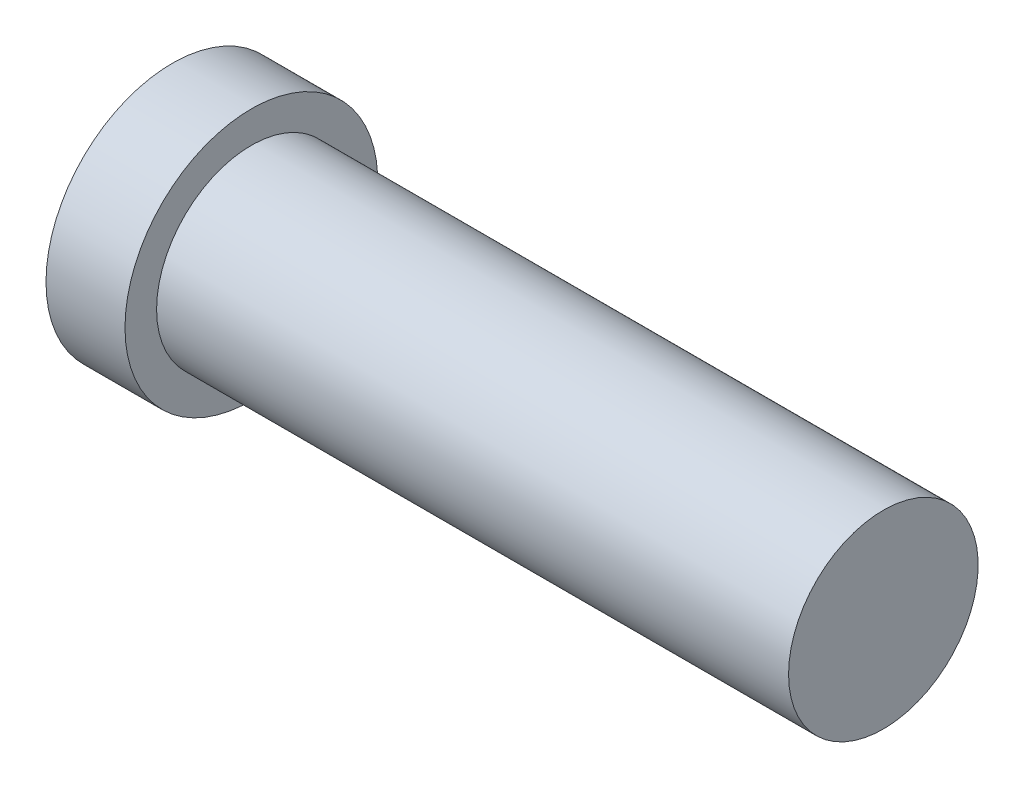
ISO-10303-21;
HEADER;
FILE_DESCRIPTION(('STEP AP214'),'2;1');
FILE_NAME('part.step','',(''),(''),'','','');
FILE_SCHEMA(('AUTOMOTIVE_DESIGN { 1 0 10303 214 1 1 1 1 }'));
ENDSEC;
DATA;
#1=APPLICATION_CONTEXT('core data for automotive mechanical design processes');
#2=APPLICATION_PROTOCOL_DEFINITION('international standard','automotive_design',2000,#1);
#3=PRODUCT_CONTEXT('',#1,'mechanical');
#4=PRODUCT('Part','Part','',(#3));
#5=PRODUCT_RELATED_PRODUCT_CATEGORY('part','',(#4));
#6=PRODUCT_DEFINITION_FORMATION('','',#4);
#7=PRODUCT_DEFINITION_CONTEXT('part definition',#1,'design');
#8=PRODUCT_DEFINITION('design','',#6,#7);
#9=PRODUCT_DEFINITION_SHAPE('','',#8);
#10=(LENGTH_UNIT() NAMED_UNIT(*) SI_UNIT(.MILLI.,.METRE.));
#11=(NAMED_UNIT(*) PLANE_ANGLE_UNIT() SI_UNIT($,.RADIAN.));
#12=(NAMED_UNIT(*) SI_UNIT($,.STERADIAN.) SOLID_ANGLE_UNIT());
#13=UNCERTAINTY_MEASURE_WITH_UNIT(LENGTH_MEASURE(1.E-05),#10,'distance_accuracy_value','');
#14=(GEOMETRIC_REPRESENTATION_CONTEXT(3) GLOBAL_UNCERTAINTY_ASSIGNED_CONTEXT((#13)) GLOBAL_UNIT_ASSIGNED_CONTEXT((#10,
#11,#12)) REPRESENTATION_CONTEXT('',''));
#15=CARTESIAN_POINT('',(0.,0.,0.));
#16=DIRECTION('',(0.,0.,1.));
#17=DIRECTION('',(1.,0.,0.));
#18=AXIS2_PLACEMENT_3D('',#15,#16,#17);
#19=CARTESIAN_POINT('',(0.,6.,0.));
#20=DIRECTION('',(-1.,0.,0.));
#21=DIRECTION('',(0.,0.,1.));
#22=AXIS2_PLACEMENT_3D('',#19,#20,#21);
#23=PLANE('',#22);
#24=CARTESIAN_POINT('',(0.,0.,0.));
#25=DIRECTION('',(-1.,0.,0.));
#26=DIRECTION('',(0.,0.,1.));
#27=AXIS2_PLACEMENT_3D('',#24,#25,#26);
#28=CIRCLE('',#27,6.);
#29=CARTESIAN_POINT('',(0.,0.,6.));
#30=VERTEX_POINT('',#29);
#31=EDGE_CURVE('E10',#30,#30,#28,.T.);
#32=ORIENTED_EDGE('',*,*,#31,.F.);
#33=EDGE_LOOP('',(#32));
#34=FACE_BOUND('',#33,.T.);
#35=ADVANCED_FACE('F32',(#34),#23,.F.);
#36=CARTESIAN_POINT('',(-90.,0.,0.));
#37=DIRECTION('',(-1.,0.,0.));
#38=DIRECTION('',(0.,0.,1.));
#39=AXIS2_PLACEMENT_3D('',#36,#37,#38);
#40=CYLINDRICAL_SURFACE('',#39,6.);
#41=CARTESIAN_POINT('',(-40.,0.,0.));
#42=DIRECTION('',(-1.,0.,0.));
#43=DIRECTION('',(0.,0.,1.));
#44=AXIS2_PLACEMENT_3D('',#41,#42,#43);
#45=CIRCLE('',#44,6.);
#46=CARTESIAN_POINT('',(-40.,0.,6.));
#47=VERTEX_POINT('',#46);
#48=EDGE_CURVE('E38',#47,#47,#45,.T.);
#49=ORIENTED_EDGE('',*,*,#48,.F.);
#50=EDGE_LOOP('',(#49));
#51=FACE_BOUND('',#50,.T.);
#52=ORIENTED_EDGE('',*,*,#31,.T.);
#53=EDGE_LOOP('',(#52));
#54=FACE_BOUND('',#53,.T.);
#55=ADVANCED_FACE('F62',(#51,#54),#40,.T.);
#56=CARTESIAN_POINT('',(-40.,7.99999999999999,0.));
#57=DIRECTION('',(-1.,0.,0.));
#58=DIRECTION('',(0.,0.,1.));
#59=AXIS2_PLACEMENT_3D('',#56,#57,#58);
#60=PLANE('',#59);
#61=CARTESIAN_POINT('',(-40.,0.,0.));
#62=DIRECTION('',(-1.,0.,0.));
#63=DIRECTION('',(0.,0.,1.));
#64=AXIS2_PLACEMENT_3D('',#61,#62,#63);
#65=CIRCLE('',#64,7.99999999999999);
#66=CARTESIAN_POINT('',(-40.,0.,7.99999999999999));
#67=VERTEX_POINT('',#66);
#68=EDGE_CURVE('E42',#67,#67,#65,.T.);
#69=ORIENTED_EDGE('',*,*,#68,.F.);
#70=EDGE_LOOP('',(#69));
#71=FACE_BOUND('',#70,.T.);
#72=ORIENTED_EDGE('',*,*,#48,.T.);
#73=EDGE_LOOP('',(#72));
#74=FACE_BOUND('',#73,.T.);
#75=ADVANCED_FACE('F57',(#71,#74),#60,.F.);
#76=CARTESIAN_POINT('',(-90.,0.,0.));
#77=DIRECTION('',(-1.,0.,0.));
#78=DIRECTION('',(0.,0.,1.));
#79=AXIS2_PLACEMENT_3D('',#76,#77,#78);
#80=CYLINDRICAL_SURFACE('',#79,7.99999999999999);
#81=CARTESIAN_POINT('',(-45.,0.,0.));
#82=DIRECTION('',(-1.,0.,0.));
#83=DIRECTION('',(0.,0.,1.));
#84=AXIS2_PLACEMENT_3D('',#81,#82,#83);
#85=CIRCLE('',#84,7.99999999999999);
#86=CARTESIAN_POINT('',(-45.,0.,7.99999999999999));
#87=VERTEX_POINT('',#86);
#88=EDGE_CURVE('E46',#87,#87,#85,.T.);
#89=ORIENTED_EDGE('',*,*,#88,.F.);
#90=EDGE_LOOP('',(#89));
#91=FACE_BOUND('',#90,.T.);
#92=ORIENTED_EDGE('',*,*,#68,.T.);
#93=EDGE_LOOP('',(#92));
#94=FACE_BOUND('',#93,.T.);
#95=ADVANCED_FACE('F54',(#91,#94),#80,.T.);
#96=CARTESIAN_POINT('',(-45.,0.,0.));
#97=DIRECTION('',(1.,0.,0.));
#98=DIRECTION('',(0.,0.,-1.));
#99=AXIS2_PLACEMENT_3D('',#96,#97,#98);
#100=PLANE('',#99);
#101=ORIENTED_EDGE('',*,*,#88,.T.);
#102=EDGE_LOOP('',(#101));
#103=FACE_BOUND('',#102,.T.);
#104=ADVANCED_FACE('F52',(#103),#100,.F.);
#105=CLOSED_SHELL('',(#35,#55,#75,#95,#104));
#106=MANIFOLD_SOLID_BREP('B2',#105);
#107=ADVANCED_BREP_SHAPE_REPRESENTATION('',(#18,#106),#14);
#108=SHAPE_DEFINITION_REPRESENTATION(#9,#107);
ENDSEC;
END-ISO-10303-21;
